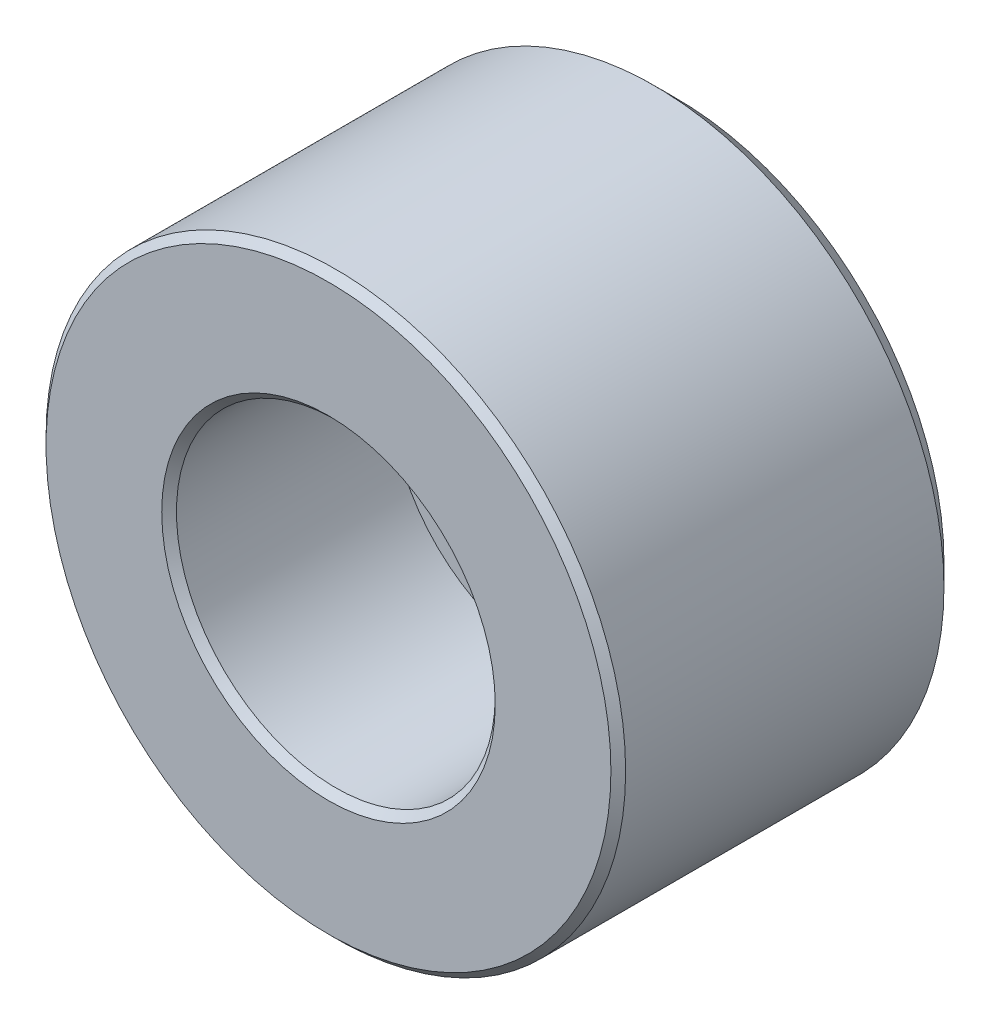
ISO-10303-21;
HEADER;
FILE_DESCRIPTION(('STEP AP214'),'2;1');
FILE_NAME('part.step','',(''),(''),'','','');
FILE_SCHEMA(('AUTOMOTIVE_DESIGN { 1 0 10303 214 1 1 1 1 }'));
ENDSEC;
DATA;
#1=APPLICATION_CONTEXT('core data for automotive mechanical design processes');
#2=APPLICATION_PROTOCOL_DEFINITION('international standard','automotive_design',2000,#1);
#3=PRODUCT_CONTEXT('',#1,'mechanical');
#4=PRODUCT('Part','Part','',(#3));
#5=PRODUCT_RELATED_PRODUCT_CATEGORY('part','',(#4));
#6=PRODUCT_DEFINITION_FORMATION('','',#4);
#7=PRODUCT_DEFINITION_CONTEXT('part definition',#1,'design');
#8=PRODUCT_DEFINITION('design','',#6,#7);
#9=PRODUCT_DEFINITION_SHAPE('','',#8);
#10=(LENGTH_UNIT() NAMED_UNIT(*) SI_UNIT(.MILLI.,.METRE.));
#11=(NAMED_UNIT(*) PLANE_ANGLE_UNIT() SI_UNIT($,.RADIAN.));
#12=(NAMED_UNIT(*) SI_UNIT($,.STERADIAN.) SOLID_ANGLE_UNIT());
#13=UNCERTAINTY_MEASURE_WITH_UNIT(LENGTH_MEASURE(1.E-05),#10,'distance_accuracy_value','');
#14=(GEOMETRIC_REPRESENTATION_CONTEXT(3) GLOBAL_UNCERTAINTY_ASSIGNED_CONTEXT((#13)) GLOBAL_UNIT_ASSIGNED_CONTEXT((#10,
#11,#12)) REPRESENTATION_CONTEXT('',''));
#15=CARTESIAN_POINT('',(0.,0.,0.));
#16=DIRECTION('',(0.,0.,1.));
#17=DIRECTION('',(1.,0.,0.));
#18=AXIS2_PLACEMENT_3D('',#15,#16,#17);
#19=CARTESIAN_POINT('',(0.,0.,12.));
#20=DIRECTION('',(0.,0.,1.));
#21=DIRECTION('',(1.,0.,0.));
#22=AXIS2_PLACEMENT_3D('',#19,#20,#21);
#23=CYLINDRICAL_SURFACE('',#22,3.3);
#24=CARTESIAN_POINT('',(0.,0.,0.256));
#25=DIRECTION('',(0.,0.,1.));
#26=DIRECTION('',(1.,0.,0.));
#27=AXIS2_PLACEMENT_3D('',#24,#25,#26);
#28=CIRCLE('',#27,3.3);
#29=CARTESIAN_POINT('',(3.3,0.,0.256));
#30=VERTEX_POINT('',#29);
#31=EDGE_CURVE('E32',#30,#30,#28,.T.);
#32=ORIENTED_EDGE('',*,*,#31,.F.);
#33=EDGE_LOOP('',(#32));
#34=FACE_BOUND('',#33,.T.);
#35=CARTESIAN_POINT('',(0.,0.,4.38));
#36=DIRECTION('',(0.,0.,1.));
#37=DIRECTION('',(1.,0.,0.));
#38=AXIS2_PLACEMENT_3D('',#35,#36,#37);
#39=CIRCLE('',#38,3.3);
#40=CARTESIAN_POINT('',(3.3,0.,4.38));
#41=VERTEX_POINT('',#40);
#42=EDGE_CURVE('E30',#41,#41,#39,.F.);
#43=ORIENTED_EDGE('',*,*,#42,.F.);
#44=EDGE_LOOP('',(#43));
#45=FACE_BOUND('',#44,.T.);
#46=ADVANCED_FACE('F12',(#34,#45),#23,.F.);
#47=CARTESIAN_POINT('',(0.,0.,0.));
#48=DIRECTION('',(0.,0.,1.));
#49=DIRECTION('',(1.,0.,0.));
#50=AXIS2_PLACEMENT_3D('',#47,#48,#49);
#51=CYLINDRICAL_SURFACE('',#50,10.);
#52=CARTESIAN_POINT('',(0.,0.,0.762));
#53=DIRECTION('',(0.,0.,1.));
#54=DIRECTION('',(1.,0.,0.));
#55=AXIS2_PLACEMENT_3D('',#52,#53,#54);
#56=CIRCLE('',#55,10.);
#57=CARTESIAN_POINT('',(10.,0.,0.762));
#58=VERTEX_POINT('',#57);
#59=EDGE_CURVE('E27',#58,#58,#56,.T.);
#60=ORIENTED_EDGE('',*,*,#59,.T.);
#61=EDGE_LOOP('',(#60));
#62=FACE_BOUND('',#61,.T.);
#63=CARTESIAN_POINT('',(0.,0.,11.746));
#64=DIRECTION('',(0.,0.,1.));
#65=DIRECTION('',(1.,0.,0.));
#66=AXIS2_PLACEMENT_3D('',#63,#64,#65);
#67=CIRCLE('',#66,10.);
#68=CARTESIAN_POINT('',(10.,0.,11.746));
#69=VERTEX_POINT('',#68);
#70=EDGE_CURVE('E37',#69,#69,#67,.F.);
#71=ORIENTED_EDGE('',*,*,#70,.T.);
#72=EDGE_LOOP('',(#71));
#73=FACE_BOUND('',#72,.T.);
#74=ADVANCED_FACE('F68',(#62,#73),#51,.T.);
#75=CARTESIAN_POINT('',(0.,0.,0.));
#76=DIRECTION('',(0.,0.,1.));
#77=DIRECTION('',(1.,0.,0.));
#78=AXIS2_PLACEMENT_3D('',#75,#76,#77);
#79=PLANE('',#78);
#80=CARTESIAN_POINT('',(0.,0.,0.));
#81=DIRECTION('',(0.,0.,1.));
#82=DIRECTION('',(1.,0.,0.));
#83=AXIS2_PLACEMENT_3D('',#80,#81,#82);
#84=CIRCLE('',#83,3.556);
#85=CARTESIAN_POINT('',(3.556,0.,0.));
#86=VERTEX_POINT('',#85);
#87=EDGE_CURVE('E43',#86,#86,#84,.T.);
#88=ORIENTED_EDGE('',*,*,#87,.T.);
#89=EDGE_LOOP('',(#88));
#90=FACE_BOUND('',#89,.T.);
#91=CARTESIAN_POINT('',(0.,0.,0.));
#92=DIRECTION('',(0.,0.,1.));
#93=DIRECTION('',(1.,0.,0.));
#94=AXIS2_PLACEMENT_3D('',#91,#92,#93);
#95=CIRCLE('',#94,9.238);
#96=CARTESIAN_POINT('',(9.238,0.,0.));
#97=VERTEX_POINT('',#96);
#98=EDGE_CURVE('E23',#97,#97,#95,.F.);
#99=ORIENTED_EDGE('',*,*,#98,.T.);
#100=EDGE_LOOP('',(#99));
#101=FACE_BOUND('',#100,.T.);
#102=ADVANCED_FACE('F74',(#90,#101),#79,.F.);
#103=CARTESIAN_POINT('',(0.,0.,12.));
#104=DIRECTION('',(0.,0.,1.));
#105=DIRECTION('',(1.,0.,0.));
#106=AXIS2_PLACEMENT_3D('',#103,#104,#105);
#107=PLANE('',#106);
#108=CARTESIAN_POINT('',(0.,0.,12.));
#109=DIRECTION('',(0.,0.,1.));
#110=DIRECTION('',(1.,0.,0.));
#111=AXIS2_PLACEMENT_3D('',#108,#109,#110);
#112=CIRCLE('',#111,5.754);
#113=CARTESIAN_POINT('',(5.754,0.,12.));
#114=VERTEX_POINT('',#113);
#115=EDGE_CURVE('E8',#114,#114,#112,.F.);
#116=ORIENTED_EDGE('',*,*,#115,.T.);
#117=EDGE_LOOP('',(#116));
#118=FACE_BOUND('',#117,.T.);
#119=CARTESIAN_POINT('',(0.,0.,12.));
#120=DIRECTION('',(0.,0.,1.));
#121=DIRECTION('',(1.,0.,0.));
#122=AXIS2_PLACEMENT_3D('',#119,#120,#121);
#123=CIRCLE('',#122,9.746);
#124=CARTESIAN_POINT('',(9.746,0.,12.));
#125=VERTEX_POINT('',#124);
#126=EDGE_CURVE('E40',#125,#125,#123,.T.);
#127=ORIENTED_EDGE('',*,*,#126,.T.);
#128=EDGE_LOOP('',(#127));
#129=FACE_BOUND('',#128,.T.);
#130=ADVANCED_FACE('F86',(#118,#129),#107,.T.);
#131=CARTESIAN_POINT('',(0.,0.,12.));
#132=DIRECTION('',(0.,0.,-1.));
#133=DIRECTION('',(-1.,0.,0.));
#134=AXIS2_PLACEMENT_3D('',#131,#132,#133);
#135=CONICAL_SURFACE('',#134,9.746,0.785398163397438);
#136=ORIENTED_EDGE('',*,*,#70,.F.);
#137=EDGE_LOOP('',(#136));
#138=FACE_BOUND('',#137,.T.);
#139=ORIENTED_EDGE('',*,*,#126,.F.);
#140=EDGE_LOOP('',(#139));
#141=FACE_BOUND('',#140,.T.);
#142=ADVANCED_FACE('F89',(#138,#141),#135,.T.);
#143=CARTESIAN_POINT('',(0.,0.,0.762));
#144=DIRECTION('',(0.,0.,1.));
#145=DIRECTION('',(1.,0.,0.));
#146=AXIS2_PLACEMENT_3D('',#143,#144,#145);
#147=CONICAL_SURFACE('',#146,10.,0.785398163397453);
#148=ORIENTED_EDGE('',*,*,#98,.F.);
#149=EDGE_LOOP('',(#148));
#150=FACE_BOUND('',#149,.T.);
#151=ORIENTED_EDGE('',*,*,#59,.F.);
#152=EDGE_LOOP('',(#151));
#153=FACE_BOUND('',#152,.T.);
#154=ADVANCED_FACE('F82',(#150,#153),#147,.T.);
#155=CARTESIAN_POINT('',(0.,0.,0.256));
#156=DIRECTION('',(0.,0.,-1.));
#157=DIRECTION('',(-1.,0.,0.));
#158=AXIS2_PLACEMENT_3D('',#155,#156,#157);
#159=CONICAL_SURFACE('',#158,3.3,0.785398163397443);
#160=ORIENTED_EDGE('',*,*,#87,.F.);
#161=EDGE_LOOP('',(#160));
#162=FACE_BOUND('',#161,.T.);
#163=ORIENTED_EDGE('',*,*,#31,.T.);
#164=EDGE_LOOP('',(#163));
#165=FACE_BOUND('',#164,.T.);
#166=ADVANCED_FACE('F64',(#162,#165),#159,.F.);
#167=CARTESIAN_POINT('',(0.,0.,4.38));
#168=DIRECTION('',(0.,0.,1.));
#169=DIRECTION('',(1.,0.,0.));
#170=AXIS2_PLACEMENT_3D('',#167,#168,#169);
#171=PLANE('',#170);
#172=CARTESIAN_POINT('',(0.,0.,4.38));
#173=DIRECTION('',(0.,0.,1.));
#174=DIRECTION('',(1.,0.,0.));
#175=AXIS2_PLACEMENT_3D('',#172,#173,#174);
#176=CIRCLE('',#175,5.5);
#177=CARTESIAN_POINT('',(5.5,0.,4.38));
#178=VERTEX_POINT('',#177);
#179=EDGE_CURVE('E33',#178,#178,#176,.T.);
#180=ORIENTED_EDGE('',*,*,#179,.T.);
#181=EDGE_LOOP('',(#180));
#182=FACE_BOUND('',#181,.T.);
#183=ORIENTED_EDGE('',*,*,#42,.T.);
#184=EDGE_LOOP('',(#183));
#185=FACE_BOUND('',#184,.T.);
#186=ADVANCED_FACE('F51',(#182,#185),#171,.T.);
#187=CARTESIAN_POINT('',(0.,0.,4.38));
#188=DIRECTION('',(0.,0.,1.));
#189=DIRECTION('',(1.,0.,0.));
#190=AXIS2_PLACEMENT_3D('',#187,#188,#189);
#191=CYLINDRICAL_SURFACE('',#190,5.5);
#192=CARTESIAN_POINT('',(0.,0.,11.746));
#193=DIRECTION('',(0.,0.,1.));
#194=DIRECTION('',(1.,0.,0.));
#195=AXIS2_PLACEMENT_3D('',#192,#193,#194);
#196=CIRCLE('',#195,5.5);
#197=CARTESIAN_POINT('',(5.5,0.,11.746));
#198=VERTEX_POINT('',#197);
#199=EDGE_CURVE('E19',#198,#198,#196,.T.);
#200=ORIENTED_EDGE('',*,*,#199,.T.);
#201=EDGE_LOOP('',(#200));
#202=FACE_BOUND('',#201,.T.);
#203=ORIENTED_EDGE('',*,*,#179,.F.);
#204=EDGE_LOOP('',(#203));
#205=FACE_BOUND('',#204,.T.);
#206=ADVANCED_FACE('F54',(#202,#205),#191,.F.);
#207=CARTESIAN_POINT('',(0.,0.,11.746));
#208=DIRECTION('',(0.,0.,1.));
#209=DIRECTION('',(1.,0.,0.));
#210=AXIS2_PLACEMENT_3D('',#207,#208,#209);
#211=CONICAL_SURFACE('',#210,5.5,0.78539816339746);
#212=ORIENTED_EDGE('',*,*,#115,.F.);
#213=EDGE_LOOP('',(#212));
#214=FACE_BOUND('',#213,.T.);
#215=ORIENTED_EDGE('',*,*,#199,.F.);
#216=EDGE_LOOP('',(#215));
#217=FACE_BOUND('',#216,.T.);
#218=ADVANCED_FACE('F14',(#214,#217),#211,.F.);
#219=CLOSED_SHELL('',(#46,#74,#102,#130,#142,#154,#166,#186,#206,#218));
#220=MANIFOLD_SOLID_BREP('B1',#219);
#221=ADVANCED_BREP_SHAPE_REPRESENTATION('',(#18,#220),#14);
#222=SHAPE_DEFINITION_REPRESENTATION(#9,#221);
ENDSEC;
END-ISO-10303-21;
